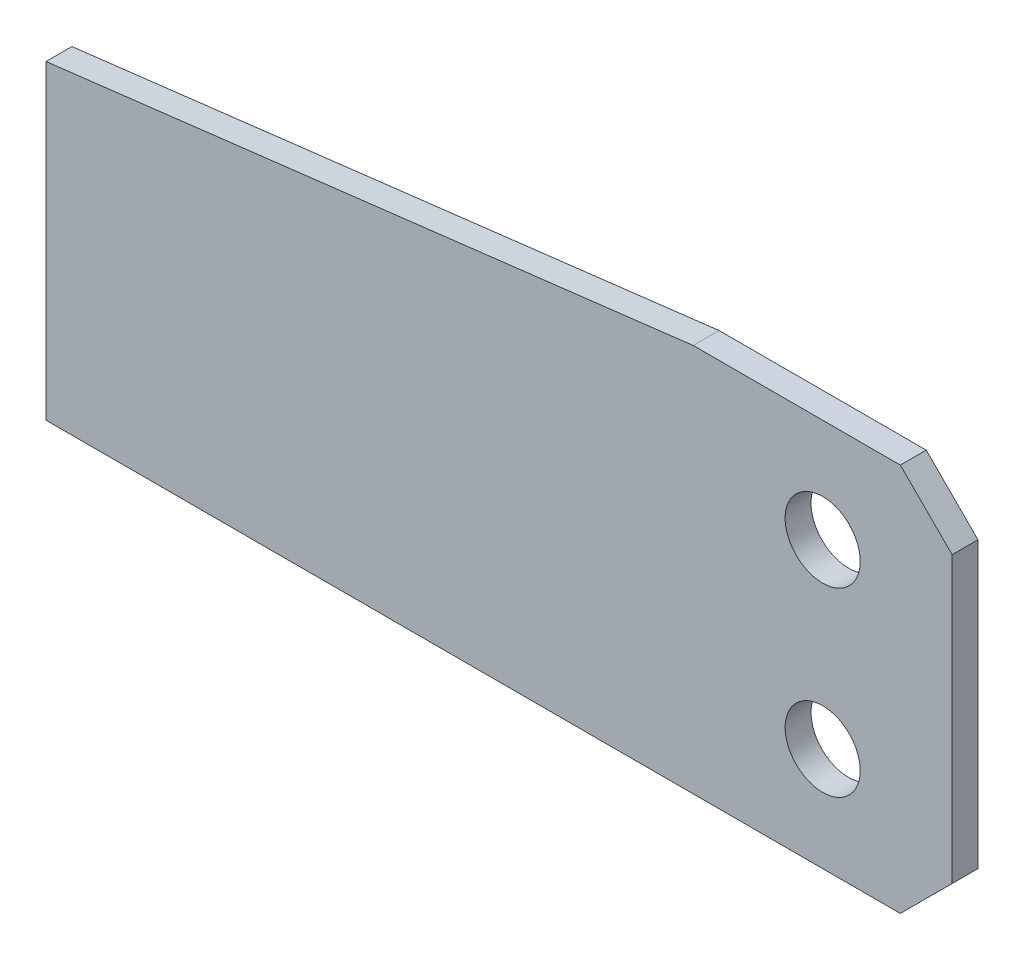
from build123d import *

# Parameters (mm, degrees)
ESQUISSE1_R          = 14.5
BASE_EXTRUSION_DEPTH = 10


with BuildPart() as part:
    # Esquisse1 → Base-Extrusion (new body)
    with BuildSketch(Plane.XY):
        Polygon((-100, 0), (-350, -30), (-350, -150), (-20, -150), (0, -130), (0, -20), (-20, 0), align=None)
        with Locations((-50, -40)):
            Circle(ESQUISSE1_R, mode=Mode.SUBTRACT)
        with Locations((-50, -110)):
            Circle(ESQUISSE1_R, mode=Mode.SUBTRACT)
    extrude(amount=BASE_EXTRUSION_DEPTH)


solid = part.part
